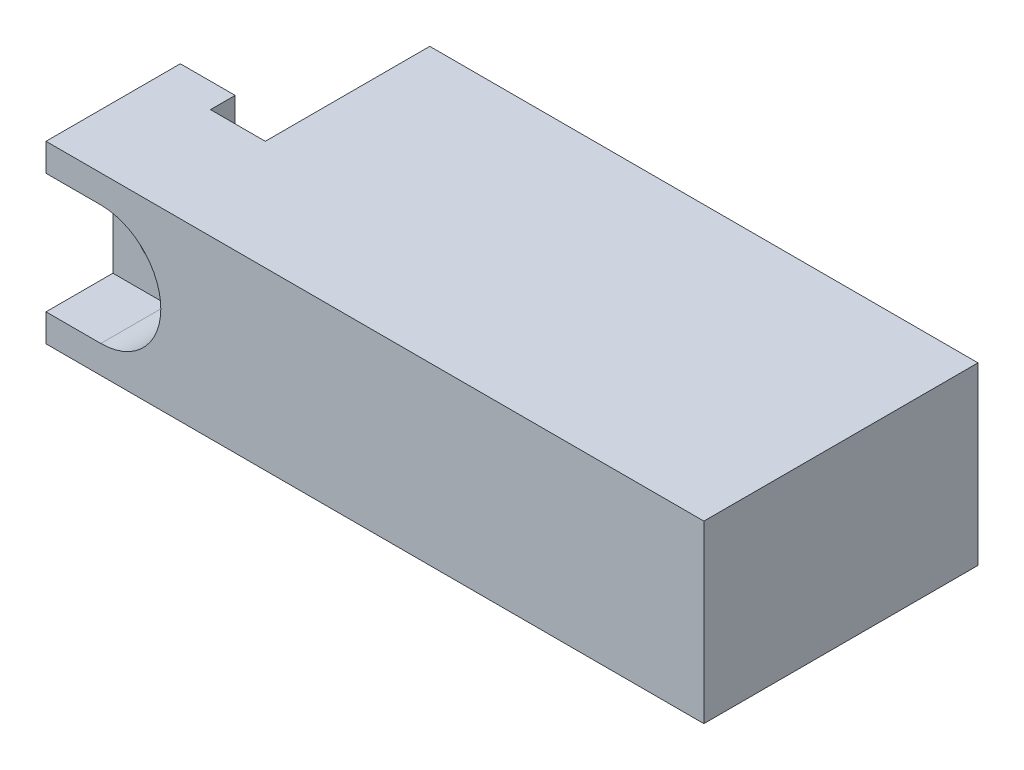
from build123d import *

# Parameters (mm, degrees)
EXTRUDE1_DEPTH                                 = 4.064
CBORE_FOR_4_SOCKET_HEAD_CAP_SCREW1_D           = 3.2639
CBORE_FOR_4_SOCKET_HEAD_CAP_SCREW1_CBORE_D     = 5.55752
CBORE_FOR_4_SOCKET_HEAD_CAP_SCREW1_CBORE_DEPTH = 3.0988
SKETCH4_W                                      = 2.54
SKETCH4_H                                      = 5.55752
CUT_EXTRUDE1_DEPTH                             = 3.0988
CUT_EXTRUDE2_DEPTH                             = 0.127


with BuildPart() as part:
    # Sketch1 → Extrude1 (new, symmetric)
    with BuildSketch(Plane(origin=(0, 0, 0), x_dir=(1, 0, 0), z_dir=(0, 1, 0))):
        Polygon((-5.08, 6.35), (-5.08, 0), (25.4, 0), (25.4, 12.7), (0, 12.7), (0, 5.08), (-2.54, 5.08), (-2.54, 6.35), align=None)
    extrude(amount=EXTRUDE1_DEPTH, both=True)

    # CBORE for _4 Socket Head Cap Screw1 (through all)
    with Locations(Plane(origin=(-2.54, 0, 0), x_dir=(1, 0, 0), z_dir=(0, 0, 1))):
        with Locations((0, 0)):
            CounterBoreHole(CBORE_FOR_4_SOCKET_HEAD_CAP_SCREW1_D / 2, CBORE_FOR_4_SOCKET_HEAD_CAP_SCREW1_CBORE_D / 2, CBORE_FOR_4_SOCKET_HEAD_CAP_SCREW1_CBORE_DEPTH)

    # Sketch4 → Cut-Extrude1 (cut)
    with BuildSketch(Plane.XY):
        with Locations((-3.81, 0)):
            Rectangle(SKETCH4_W, SKETCH4_H)
    extrude(amount=-CUT_EXTRUDE1_DEPTH, mode=Mode.SUBTRACT)

    # Sketch5 → Cut-Extrude2 (cut)
    with BuildSketch(Plane(origin=(0, 0, -6.35), x_dir=(-1, 0, 0), z_dir=(0, 0, -1))):
        with BuildLine():
            Line((2.54, 4.064), (2.54, 1.63195))
            ThreePointArc((2.54, 1.63195), (4.17195, 0), (2.54, -1.63195))
            Line((2.54, -1.63195), (2.54, -4.064))
            Line((2.54, -4.064), (5.08, -4.064))
            Line((5.08, -4.064), (5.08, 4.064))
            Line((5.08, 4.064), (2.54, 4.064))
        make_face()
    extrude(amount=-CUT_EXTRUDE2_DEPTH, mode=Mode.SUBTRACT)


solid = part.part
